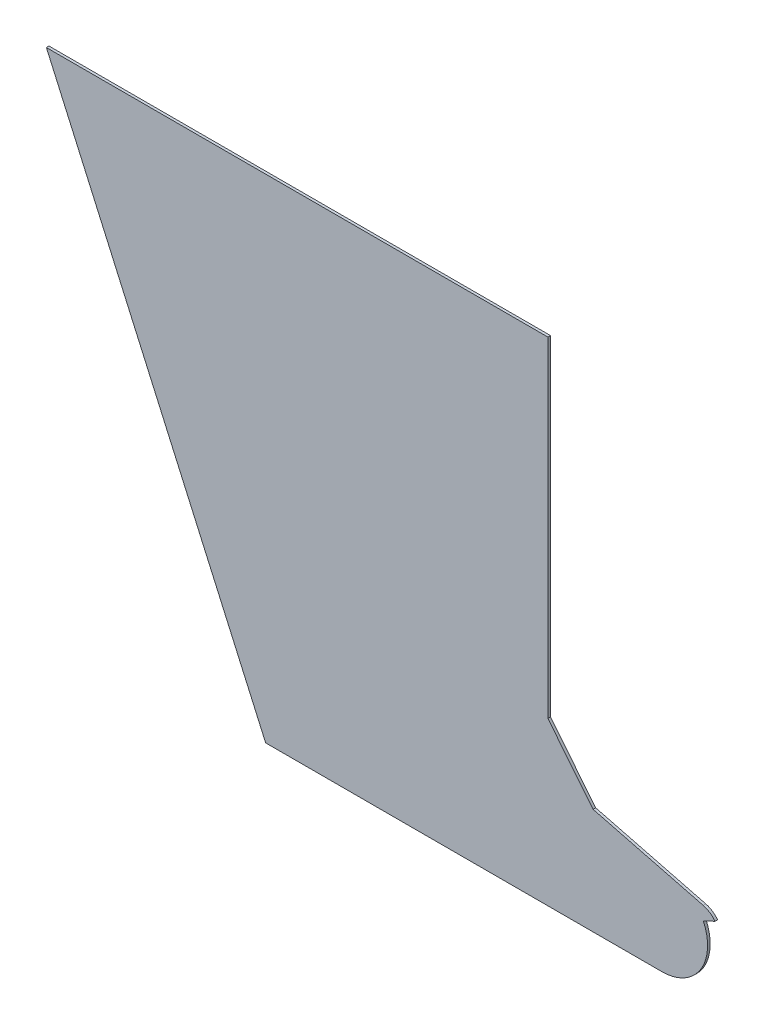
from build123d import *

# Parameters (mm, degrees)
BOSS_EXTRUDE1_DEPTH = 6.35


with BuildPart() as part:
    # Sketch1 → Boss-Extrude1 (new body)
    with BuildSketch(Plane.XY):
        with BuildLine():
            Line((1162.911745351, -885.405968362), (1162.911745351, -1697.912888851))
            Line((1162.911745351, -1697.912888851), (1274.112024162, -1835.89345176))
            Line((1274.112024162, -1835.89345176), (1544.786111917, -1905.035605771))
            ThreePointArc((1544.786111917, -1905.035605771), (1561.076604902, -1912.284015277), (1574.052858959, -1924.512524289))
            Line((1574.052858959, -1924.512524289), (1545.277586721, -1937.930654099))
            ThreePointArc((1545.277586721, -1937.930654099), (1538.237248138, -2045.345463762), (1443.861745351, -2097.121637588))
            Line((1443.861745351, -2097.121637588), (468.615358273, -2097.121637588))
            Line((468.615358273, -2097.121637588), (-70.773034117, -885.405968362))
            Line((-70.773034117, -885.405968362), (1162.911745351, -885.405968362))
        make_face()
    extrude(amount=BOSS_EXTRUDE1_DEPTH)


solid = part.part
